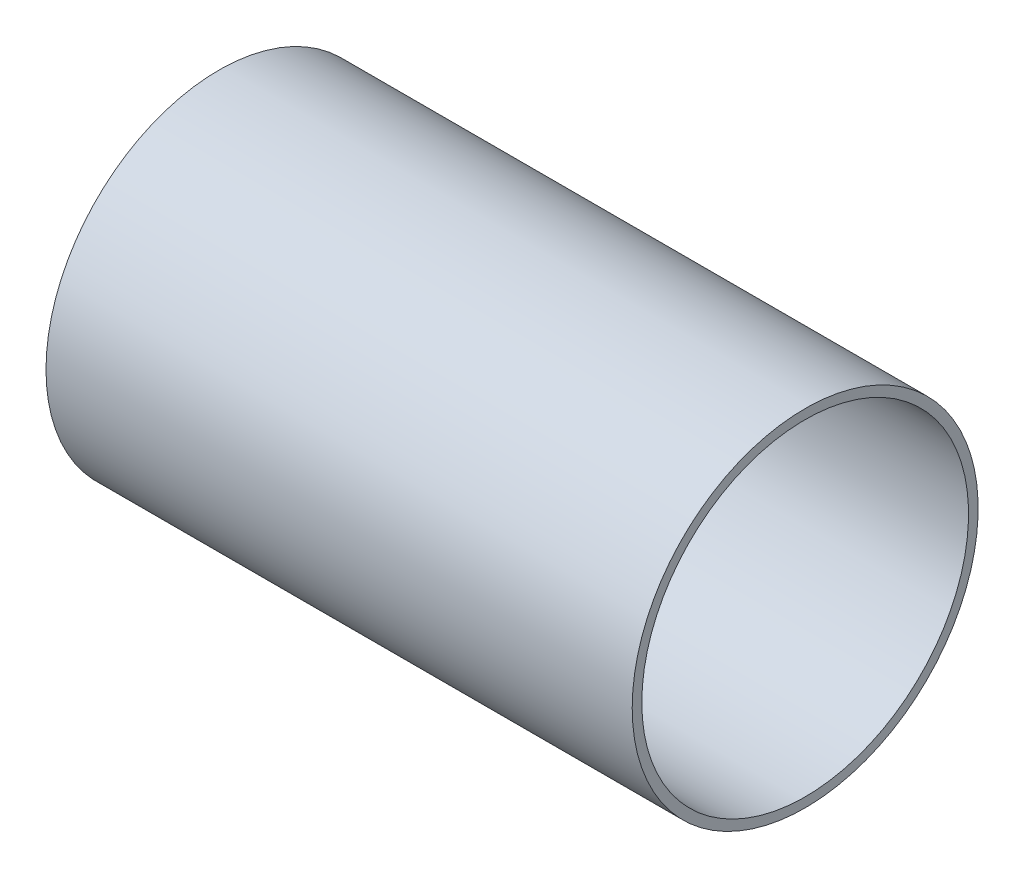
ISO-10303-21;
HEADER;
FILE_DESCRIPTION(('STEP AP214'),'2;1');
FILE_NAME('part.step','',(''),(''),'','','');
FILE_SCHEMA(('AUTOMOTIVE_DESIGN { 1 0 10303 214 1 1 1 1 }'));
ENDSEC;
DATA;
#1=APPLICATION_CONTEXT('core data for automotive mechanical design processes');
#2=APPLICATION_PROTOCOL_DEFINITION('international standard','automotive_design',2000,#1);
#3=PRODUCT_CONTEXT('',#1,'mechanical');
#4=PRODUCT('Part','Part','',(#3));
#5=PRODUCT_RELATED_PRODUCT_CATEGORY('part','',(#4));
#6=PRODUCT_DEFINITION_FORMATION('','',#4);
#7=PRODUCT_DEFINITION_CONTEXT('part definition',#1,'design');
#8=PRODUCT_DEFINITION('design','',#6,#7);
#9=PRODUCT_DEFINITION_SHAPE('','',#8);
#10=(LENGTH_UNIT() NAMED_UNIT(*) SI_UNIT(.MILLI.,.METRE.));
#11=(NAMED_UNIT(*) PLANE_ANGLE_UNIT() SI_UNIT($,.RADIAN.));
#12=(NAMED_UNIT(*) SI_UNIT($,.STERADIAN.) SOLID_ANGLE_UNIT());
#13=UNCERTAINTY_MEASURE_WITH_UNIT(LENGTH_MEASURE(1.E-05),#10,'distance_accuracy_value','');
#14=(GEOMETRIC_REPRESENTATION_CONTEXT(3) GLOBAL_UNCERTAINTY_ASSIGNED_CONTEXT((#13)) GLOBAL_UNIT_ASSIGNED_CONTEXT((#10,
#11,#12)) REPRESENTATION_CONTEXT('',''));
#15=CARTESIAN_POINT('',(0.,0.,0.));
#16=DIRECTION('',(0.,0.,1.));
#17=DIRECTION('',(1.,0.,0.));
#18=AXIS2_PLACEMENT_3D('',#15,#16,#17);
#19=CARTESIAN_POINT('',(-387.35,0.,0.));
#20=DIRECTION('',(-1.,0.,0.));
#21=DIRECTION('',(0.,0.,1.));
#22=AXIS2_PLACEMENT_3D('',#19,#20,#21);
#23=PLANE('',#22);
#24=CARTESIAN_POINT('',(-387.35,0.,0.));
#25=DIRECTION('',(-1.,0.,0.));
#26=DIRECTION('',(0.,0.,1.));
#27=AXIS2_PLACEMENT_3D('',#24,#25,#26);
#28=CIRCLE('',#27,114.3);
#29=CARTESIAN_POINT('',(-387.35,0.,114.3));
#30=VERTEX_POINT('',#29);
#31=EDGE_CURVE('E10',#30,#30,#28,.T.);
#32=ORIENTED_EDGE('',*,*,#31,.T.);
#33=EDGE_LOOP('',(#32));
#34=FACE_BOUND('',#33,.T.);
#35=CARTESIAN_POINT('',(-387.35,0.,0.));
#36=DIRECTION('',(-1.,0.,0.));
#37=DIRECTION('',(0.,0.,1.));
#38=AXIS2_PLACEMENT_3D('',#35,#36,#37);
#39=CIRCLE('',#38,107.95);
#40=CARTESIAN_POINT('',(-387.35,0.,107.95));
#41=VERTEX_POINT('',#40);
#42=EDGE_CURVE('E42',#41,#41,#39,.T.);
#43=ORIENTED_EDGE('',*,*,#42,.F.);
#44=EDGE_LOOP('',(#43));
#45=FACE_BOUND('',#44,.T.);
#46=ADVANCED_FACE('F31',(#34,#45),#23,.T.);
#47=CARTESIAN_POINT('',(0.,0.,0.));
#48=DIRECTION('',(-1.,0.,0.));
#49=DIRECTION('',(0.,0.,1.));
#50=AXIS2_PLACEMENT_3D('',#47,#48,#49);
#51=PLANE('',#50);
#52=CARTESIAN_POINT('',(0.,0.,0.));
#53=DIRECTION('',(-1.,0.,0.));
#54=DIRECTION('',(0.,0.,1.));
#55=AXIS2_PLACEMENT_3D('',#52,#53,#54);
#56=CIRCLE('',#55,114.3);
#57=CARTESIAN_POINT('',(0.,0.,114.3));
#58=VERTEX_POINT('',#57);
#59=EDGE_CURVE('E35',#58,#58,#56,.T.);
#60=ORIENTED_EDGE('',*,*,#59,.F.);
#61=EDGE_LOOP('',(#60));
#62=FACE_BOUND('',#61,.T.);
#63=CARTESIAN_POINT('',(0.,0.,0.));
#64=DIRECTION('',(-1.,0.,0.));
#65=DIRECTION('',(0.,0.,1.));
#66=AXIS2_PLACEMENT_3D('',#63,#64,#65);
#67=CIRCLE('',#66,107.95);
#68=CARTESIAN_POINT('',(0.,0.,107.95));
#69=VERTEX_POINT('',#68);
#70=EDGE_CURVE('E44',#69,#69,#67,.T.);
#71=ORIENTED_EDGE('',*,*,#70,.T.);
#72=EDGE_LOOP('',(#71));
#73=FACE_BOUND('',#72,.T.);
#74=ADVANCED_FACE('F54',(#62,#73),#51,.F.);
#75=CARTESIAN_POINT('',(-387.35,0.,0.));
#76=DIRECTION('',(1.,0.,0.));
#77=DIRECTION('',(0.,0.,-1.));
#78=AXIS2_PLACEMENT_3D('',#75,#76,#77);
#79=CYLINDRICAL_SURFACE('',#78,114.3);
#80=ORIENTED_EDGE('',*,*,#31,.F.);
#81=EDGE_LOOP('',(#80));
#82=FACE_BOUND('',#81,.T.);
#83=ORIENTED_EDGE('',*,*,#59,.T.);
#84=EDGE_LOOP('',(#83));
#85=FACE_BOUND('',#84,.T.);
#86=ADVANCED_FACE('F33',(#82,#85),#79,.T.);
#87=CARTESIAN_POINT('',(-387.35,0.,0.));
#88=DIRECTION('',(1.,0.,0.));
#89=DIRECTION('',(0.,0.,-1.));
#90=AXIS2_PLACEMENT_3D('',#87,#88,#89);
#91=CYLINDRICAL_SURFACE('',#90,107.95);
#92=ORIENTED_EDGE('',*,*,#42,.T.);
#93=EDGE_LOOP('',(#92));
#94=FACE_BOUND('',#93,.T.);
#95=ORIENTED_EDGE('',*,*,#70,.F.);
#96=EDGE_LOOP('',(#95));
#97=FACE_BOUND('',#96,.T.);
#98=ADVANCED_FACE('F50',(#94,#97),#91,.F.);
#99=CLOSED_SHELL('',(#46,#74,#86,#98));
#100=MANIFOLD_SOLID_BREP('B2',#99);
#101=ADVANCED_BREP_SHAPE_REPRESENTATION('',(#18,#100),#14);
#102=SHAPE_DEFINITION_REPRESENTATION(#9,#101);
ENDSEC;
END-ISO-10303-21;
